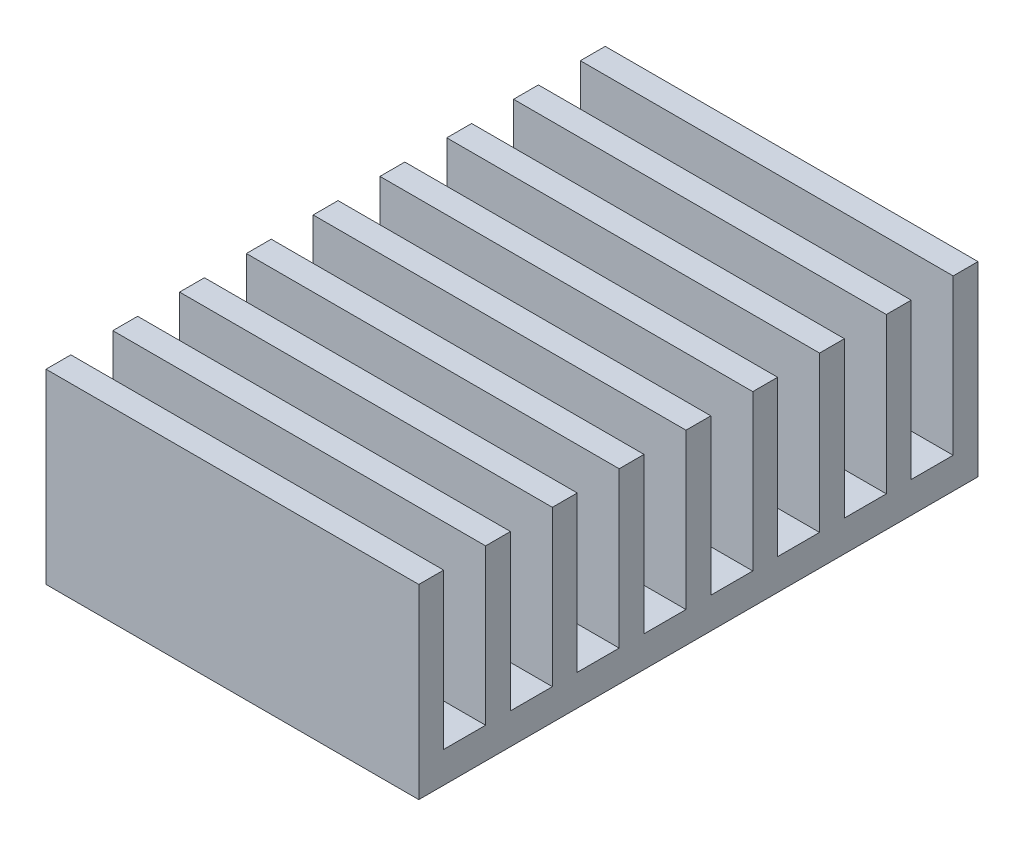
ISO-10303-21;
HEADER;
FILE_DESCRIPTION(('STEP AP214'),'2;1');
FILE_NAME('part.step','',(''),(''),'','','');
FILE_SCHEMA(('AUTOMOTIVE_DESIGN { 1 0 10303 214 1 1 1 1 }'));
ENDSEC;
DATA;
#1=APPLICATION_CONTEXT('core data for automotive mechanical design processes');
#2=APPLICATION_PROTOCOL_DEFINITION('international standard','automotive_design',2000,#1);
#3=PRODUCT_CONTEXT('',#1,'mechanical');
#4=PRODUCT('Part','Part','',(#3));
#5=PRODUCT_RELATED_PRODUCT_CATEGORY('part','',(#4));
#6=PRODUCT_DEFINITION_FORMATION('','',#4);
#7=PRODUCT_DEFINITION_CONTEXT('part definition',#1,'design');
#8=PRODUCT_DEFINITION('design','',#6,#7);
#9=PRODUCT_DEFINITION_SHAPE('','',#8);
#10=(LENGTH_UNIT() NAMED_UNIT(*) SI_UNIT(.MILLI.,.METRE.));
#11=(NAMED_UNIT(*) PLANE_ANGLE_UNIT() SI_UNIT($,.RADIAN.));
#12=(NAMED_UNIT(*) SI_UNIT($,.STERADIAN.) SOLID_ANGLE_UNIT());
#13=UNCERTAINTY_MEASURE_WITH_UNIT(LENGTH_MEASURE(1.E-05),#10,'distance_accuracy_value','');
#14=(GEOMETRIC_REPRESENTATION_CONTEXT(3) GLOBAL_UNCERTAINTY_ASSIGNED_CONTEXT((#13)) GLOBAL_UNIT_ASSIGNED_CONTEXT((#10,
#11,#12)) REPRESENTATION_CONTEXT('',''));
#15=CARTESIAN_POINT('',(0.,0.,0.));
#16=DIRECTION('',(0.,0.,1.));
#17=DIRECTION('',(1.,0.,0.));
#18=AXIS2_PLACEMENT_3D('',#15,#16,#17);
#19=CARTESIAN_POINT('',(15.,15.,-22.5));
#20=DIRECTION('',(0.,-1.,0.));
#21=DIRECTION('',(0.,0.,-1.));
#22=AXIS2_PLACEMENT_3D('',#19,#20,#21);
#23=PLANE('',#22);
#24=DIRECTION('',(0.,0.,1.));
#25=VECTOR('',#24,1.);
#26=CARTESIAN_POINT('',(15.,15.,-22.5));
#27=LINE('',#26,#25);
#28=CARTESIAN_POINT('',(15.,15.,20.5));
#29=VERTEX_POINT('',#28);
#30=CARTESIAN_POINT('',(15.,15.,22.5));
#31=VERTEX_POINT('',#30);
#32=EDGE_CURVE('E548',#29,#31,#27,.T.);
#33=ORIENTED_EDGE('',*,*,#32,.F.);
#34=DIRECTION('',(1.,0.,0.));
#35=VECTOR('',#34,1.);
#36=CARTESIAN_POINT('',(-15.,15.,20.5));
#37=LINE('',#36,#35);
#38=CARTESIAN_POINT('',(-15.,15.,20.5));
#39=VERTEX_POINT('',#38);
#40=EDGE_CURVE('E328',#39,#29,#37,.T.);
#41=ORIENTED_EDGE('',*,*,#40,.F.);
#42=DIRECTION('',(0.,0.,1.));
#43=VECTOR('',#42,1.);
#44=CARTESIAN_POINT('',(-15.,15.,-22.5));
#45=LINE('',#44,#43);
#46=CARTESIAN_POINT('',(-15.,15.,22.5));
#47=VERTEX_POINT('',#46);
#48=EDGE_CURVE('E311',#39,#47,#45,.T.);
#49=ORIENTED_EDGE('',*,*,#48,.T.);
#50=DIRECTION('',(-1.,0.,0.));
#51=VECTOR('',#50,1.);
#52=CARTESIAN_POINT('',(15.,15.,22.5));
#53=LINE('',#52,#51);
#54=EDGE_CURVE('E552',#31,#47,#53,.T.);
#55=ORIENTED_EDGE('',*,*,#54,.F.);
#56=EDGE_LOOP('',(#33,#41,#49,#55));
#57=FACE_BOUND('',#56,.T.);
#58=ADVANCED_FACE('F45',(#57),#23,.F.);
#59=CARTESIAN_POINT('',(-15.,15.,15.125));
#60=VERTEX_POINT('',#59);
#61=CARTESIAN_POINT('',(-15.,15.,17.125));
#62=VERTEX_POINT('',#61);
#63=EDGE_CURVE('E590',#60,#62,#45,.T.);
#64=ORIENTED_EDGE('',*,*,#63,.T.);
#65=DIRECTION('',(1.,0.,0.));
#66=VECTOR('',#65,1.);
#67=CARTESIAN_POINT('',(-15.,15.,17.125));
#68=LINE('',#67,#66);
#69=CARTESIAN_POINT('',(15.,15.,17.125));
#70=VERTEX_POINT('',#69);
#71=EDGE_CURVE('E331',#62,#70,#68,.T.);
#72=ORIENTED_EDGE('',*,*,#71,.T.);
#73=CARTESIAN_POINT('',(15.,15.,15.125));
#74=VERTEX_POINT('',#73);
#75=EDGE_CURVE('E658',#74,#70,#27,.T.);
#76=ORIENTED_EDGE('',*,*,#75,.F.);
#77=DIRECTION('',(1.,0.,0.));
#78=VECTOR('',#77,1.);
#79=CARTESIAN_POINT('',(-15.,15.,15.125));
#80=LINE('',#79,#78);
#81=EDGE_CURVE('E345',#60,#74,#80,.T.);
#82=ORIENTED_EDGE('',*,*,#81,.F.);
#83=EDGE_LOOP('',(#64,#72,#76,#82));
#84=FACE_BOUND('',#83,.T.);
#85=ADVANCED_FACE('F667',(#84),#23,.F.);
#86=CARTESIAN_POINT('',(-15.,15.,9.75000000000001));
#87=VERTEX_POINT('',#86);
#88=CARTESIAN_POINT('',(-15.,15.,11.75));
#89=VERTEX_POINT('',#88);
#90=EDGE_CURVE('E592',#87,#89,#45,.T.);
#91=ORIENTED_EDGE('',*,*,#90,.T.);
#92=DIRECTION('',(1.,0.,0.));
#93=VECTOR('',#92,1.);
#94=CARTESIAN_POINT('',(-15.,15.,11.75));
#95=LINE('',#94,#93);
#96=CARTESIAN_POINT('',(15.,15.,11.75));
#97=VERTEX_POINT('',#96);
#98=EDGE_CURVE('E342',#89,#97,#95,.T.);
#99=ORIENTED_EDGE('',*,*,#98,.T.);
#100=CARTESIAN_POINT('',(15.,15.,9.75000000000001));
#101=VERTEX_POINT('',#100);
#102=EDGE_CURVE('E653',#101,#97,#27,.T.);
#103=ORIENTED_EDGE('',*,*,#102,.F.);
#104=DIRECTION('',(1.,0.,0.));
#105=VECTOR('',#104,1.);
#106=CARTESIAN_POINT('',(-15.,15.,9.75000000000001));
#107=LINE('',#106,#105);
#108=EDGE_CURVE('E378',#87,#101,#107,.T.);
#109=ORIENTED_EDGE('',*,*,#108,.F.);
#110=EDGE_LOOP('',(#91,#99,#103,#109));
#111=FACE_BOUND('',#110,.T.);
#112=ADVANCED_FACE('F675',(#111),#23,.F.);
#113=CARTESIAN_POINT('',(-15.,15.,4.37500000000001));
#114=VERTEX_POINT('',#113);
#115=CARTESIAN_POINT('',(-15.,15.,6.375));
#116=VERTEX_POINT('',#115);
#117=EDGE_CURVE('E597',#114,#116,#45,.T.);
#118=ORIENTED_EDGE('',*,*,#117,.T.);
#119=DIRECTION('',(1.,0.,0.));
#120=VECTOR('',#119,1.);
#121=CARTESIAN_POINT('',(-15.,15.,6.375));
#122=LINE('',#121,#120);
#123=CARTESIAN_POINT('',(15.,15.,6.375));
#124=VERTEX_POINT('',#123);
#125=EDGE_CURVE('E375',#116,#124,#122,.T.);
#126=ORIENTED_EDGE('',*,*,#125,.T.);
#127=CARTESIAN_POINT('',(15.,15.,4.37500000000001));
#128=VERTEX_POINT('',#127);
#129=EDGE_CURVE('E648',#128,#124,#27,.T.);
#130=ORIENTED_EDGE('',*,*,#129,.F.);
#131=DIRECTION('',(1.,0.,0.));
#132=VECTOR('',#131,1.);
#133=CARTESIAN_POINT('',(-15.,15.,4.37500000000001));
#134=LINE('',#133,#132);
#135=EDGE_CURVE('E410',#114,#128,#134,.T.);
#136=ORIENTED_EDGE('',*,*,#135,.F.);
#137=EDGE_LOOP('',(#118,#126,#130,#136));
#138=FACE_BOUND('',#137,.T.);
#139=ADVANCED_FACE('F688',(#138),#23,.F.);
#140=CARTESIAN_POINT('',(-15.,15.,-0.999999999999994));
#141=VERTEX_POINT('',#140);
#142=CARTESIAN_POINT('',(-15.,15.,1.));
#143=VERTEX_POINT('',#142);
#144=EDGE_CURVE('E602',#141,#143,#45,.T.);
#145=ORIENTED_EDGE('',*,*,#144,.T.);
#146=DIRECTION('',(1.,0.,0.));
#147=VECTOR('',#146,1.);
#148=CARTESIAN_POINT('',(-15.,15.,1.));
#149=LINE('',#148,#147);
#150=CARTESIAN_POINT('',(15.,15.,1.));
#151=VERTEX_POINT('',#150);
#152=EDGE_CURVE('E406',#143,#151,#149,.T.);
#153=ORIENTED_EDGE('',*,*,#152,.T.);
#154=CARTESIAN_POINT('',(15.,15.,-0.999999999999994));
#155=VERTEX_POINT('',#154);
#156=EDGE_CURVE('E643',#155,#151,#27,.T.);
#157=ORIENTED_EDGE('',*,*,#156,.F.);
#158=DIRECTION('',(1.,0.,0.));
#159=VECTOR('',#158,1.);
#160=CARTESIAN_POINT('',(-15.,15.,-0.999999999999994));
#161=LINE('',#160,#159);
#162=EDGE_CURVE('E440',#141,#155,#161,.T.);
#163=ORIENTED_EDGE('',*,*,#162,.F.);
#164=EDGE_LOOP('',(#145,#153,#157,#163));
#165=FACE_BOUND('',#164,.T.);
#166=ADVANCED_FACE('F690',(#165),#23,.F.);
#167=CARTESIAN_POINT('',(-15.,15.,-6.375));
#168=VERTEX_POINT('',#167);
#169=CARTESIAN_POINT('',(-15.,15.,-4.375));
#170=VERTEX_POINT('',#169);
#171=EDGE_CURVE('E607',#168,#170,#45,.T.);
#172=ORIENTED_EDGE('',*,*,#171,.T.);
#173=DIRECTION('',(1.,0.,0.));
#174=VECTOR('',#173,1.);
#175=CARTESIAN_POINT('',(-15.,15.,-4.375));
#176=LINE('',#175,#174);
#177=CARTESIAN_POINT('',(15.,15.,-4.375));
#178=VERTEX_POINT('',#177);
#179=EDGE_CURVE('E436',#170,#178,#176,.T.);
#180=ORIENTED_EDGE('',*,*,#179,.T.);
#181=CARTESIAN_POINT('',(15.,15.,-6.375));
#182=VERTEX_POINT('',#181);
#183=EDGE_CURVE('E639',#182,#178,#27,.T.);
#184=ORIENTED_EDGE('',*,*,#183,.F.);
#185=DIRECTION('',(1.,0.,0.));
#186=VECTOR('',#185,1.);
#187=CARTESIAN_POINT('',(-15.,15.,-6.375));
#188=LINE('',#187,#186);
#189=EDGE_CURVE('E468',#168,#182,#188,.T.);
#190=ORIENTED_EDGE('',*,*,#189,.F.);
#191=EDGE_LOOP('',(#172,#180,#184,#190));
#192=FACE_BOUND('',#191,.T.);
#193=ADVANCED_FACE('F696',(#192),#23,.F.);
#194=CARTESIAN_POINT('',(-15.,15.,-11.75));
#195=VERTEX_POINT('',#194);
#196=CARTESIAN_POINT('',(-15.,15.,-9.75));
#197=VERTEX_POINT('',#196);
#198=EDGE_CURVE('E612',#195,#197,#45,.T.);
#199=ORIENTED_EDGE('',*,*,#198,.T.);
#200=DIRECTION('',(1.,0.,0.));
#201=VECTOR('',#200,1.);
#202=CARTESIAN_POINT('',(-15.,15.,-9.75));
#203=LINE('',#202,#201);
#204=CARTESIAN_POINT('',(15.,15.,-9.75));
#205=VERTEX_POINT('',#204);
#206=EDGE_CURVE('E465',#197,#205,#203,.T.);
#207=ORIENTED_EDGE('',*,*,#206,.T.);
#208=CARTESIAN_POINT('',(15.,15.,-11.75));
#209=VERTEX_POINT('',#208);
#210=EDGE_CURVE('E637',#209,#205,#27,.T.);
#211=ORIENTED_EDGE('',*,*,#210,.F.);
#212=DIRECTION('',(1.,0.,0.));
#213=VECTOR('',#212,1.);
#214=CARTESIAN_POINT('',(-15.,15.,-11.75));
#215=LINE('',#214,#213);
#216=EDGE_CURVE('E495',#195,#209,#215,.T.);
#217=ORIENTED_EDGE('',*,*,#216,.F.);
#218=EDGE_LOOP('',(#199,#207,#211,#217));
#219=FACE_BOUND('',#218,.T.);
#220=ADVANCED_FACE('F710',(#219),#23,.F.);
#221=CARTESIAN_POINT('',(-15.,15.,-17.125));
#222=VERTEX_POINT('',#221);
#223=CARTESIAN_POINT('',(-15.,15.,-15.125));
#224=VERTEX_POINT('',#223);
#225=EDGE_CURVE('E562',#222,#224,#45,.T.);
#226=ORIENTED_EDGE('',*,*,#225,.T.);
#227=DIRECTION('',(1.,0.,0.));
#228=VECTOR('',#227,1.);
#229=CARTESIAN_POINT('',(-15.,15.,-15.125));
#230=LINE('',#229,#228);
#231=CARTESIAN_POINT('',(15.,15.,-15.125));
#232=VERTEX_POINT('',#231);
#233=EDGE_CURVE('E492',#224,#232,#230,.T.);
#234=ORIENTED_EDGE('',*,*,#233,.T.);
#235=CARTESIAN_POINT('',(15.,15.,-17.125));
#236=VERTEX_POINT('',#235);
#237=EDGE_CURVE('E553',#236,#232,#27,.T.);
#238=ORIENTED_EDGE('',*,*,#237,.F.);
#239=DIRECTION('',(1.,0.,0.));
#240=VECTOR('',#239,1.);
#241=CARTESIAN_POINT('',(-15.,15.,-17.125));
#242=LINE('',#241,#240);
#243=EDGE_CURVE('E521',#222,#236,#242,.T.);
#244=ORIENTED_EDGE('',*,*,#243,.F.);
#245=EDGE_LOOP('',(#226,#234,#238,#244));
#246=FACE_BOUND('',#245,.T.);
#247=ADVANCED_FACE('F624',(#246),#23,.F.);
#248=CARTESIAN_POINT('',(15.,0.,22.5));
#249=DIRECTION('',(0.,0.,-1.));
#250=DIRECTION('',(-1.,0.,0.));
#251=AXIS2_PLACEMENT_3D('',#248,#249,#250);
#252=PLANE('',#251);
#253=DIRECTION('',(0.,-1.,0.));
#254=VECTOR('',#253,1.);
#255=CARTESIAN_POINT('',(-15.,0.,22.5));
#256=LINE('',#255,#254);
#257=CARTESIAN_POINT('',(-15.,0.,22.5));
#258=VERTEX_POINT('',#257);
#259=EDGE_CURVE('E330',#47,#258,#256,.T.);
#260=ORIENTED_EDGE('',*,*,#259,.T.);
#261=DIRECTION('',(-1.,0.,0.));
#262=VECTOR('',#261,1.);
#263=CARTESIAN_POINT('',(15.,0.,22.5));
#264=LINE('',#263,#262);
#265=CARTESIAN_POINT('',(15.,0.,22.5));
#266=VERTEX_POINT('',#265);
#267=EDGE_CURVE('E11',#266,#258,#264,.T.);
#268=ORIENTED_EDGE('',*,*,#267,.F.);
#269=DIRECTION('',(0.,-1.,0.));
#270=VECTOR('',#269,1.);
#271=CARTESIAN_POINT('',(15.,0.,22.5));
#272=LINE('',#271,#270);
#273=EDGE_CURVE('E538',#31,#266,#272,.T.);
#274=ORIENTED_EDGE('',*,*,#273,.F.);
#275=ORIENTED_EDGE('',*,*,#54,.T.);
#276=EDGE_LOOP('',(#260,#268,#274,#275));
#277=FACE_BOUND('',#276,.T.);
#278=ADVANCED_FACE('F47',(#277),#252,.F.);
#279=CARTESIAN_POINT('',(15.,0.,22.5));
#280=DIRECTION('',(0.,1.,0.));
#281=DIRECTION('',(0.,0.,1.));
#282=AXIS2_PLACEMENT_3D('',#279,#280,#281);
#283=PLANE('',#282);
#284=DIRECTION('',(0.,0.,-1.));
#285=VECTOR('',#284,1.);
#286=CARTESIAN_POINT('',(-15.,0.,22.5));
#287=LINE('',#286,#285);
#288=CARTESIAN_POINT('',(-15.,0.,-22.5));
#289=VERTEX_POINT('',#288);
#290=EDGE_CURVE('E556',#258,#289,#287,.T.);
#291=ORIENTED_EDGE('',*,*,#290,.T.);
#292=DIRECTION('',(-1.,0.,0.));
#293=VECTOR('',#292,1.);
#294=CARTESIAN_POINT('',(15.,0.,-22.5));
#295=LINE('',#294,#293);
#296=CARTESIAN_POINT('',(15.,0.,-22.5));
#297=VERTEX_POINT('',#296);
#298=EDGE_CURVE('E54',#297,#289,#295,.T.);
#299=ORIENTED_EDGE('',*,*,#298,.F.);
#300=DIRECTION('',(0.,0.,-1.));
#301=VECTOR('',#300,1.);
#302=CARTESIAN_POINT('',(15.,0.,22.5));
#303=LINE('',#302,#301);
#304=EDGE_CURVE('E542',#266,#297,#303,.T.);
#305=ORIENTED_EDGE('',*,*,#304,.F.);
#306=ORIENTED_EDGE('',*,*,#267,.T.);
#307=EDGE_LOOP('',(#291,#299,#305,#306));
#308=FACE_BOUND('',#307,.T.);
#309=ADVANCED_FACE('F585',(#308),#283,.F.);
#310=CARTESIAN_POINT('',(15.,0.,-22.5));
#311=DIRECTION('',(0.,0.,1.));
#312=DIRECTION('',(1.,0.,0.));
#313=AXIS2_PLACEMENT_3D('',#310,#311,#312);
#314=PLANE('',#313);
#315=DIRECTION('',(0.,1.,0.));
#316=VECTOR('',#315,1.);
#317=CARTESIAN_POINT('',(-15.,0.,-22.5));
#318=LINE('',#317,#316);
#319=CARTESIAN_POINT('',(-15.,15.,-22.5));
#320=VERTEX_POINT('',#319);
#321=EDGE_CURVE('E558',#289,#320,#318,.T.);
#322=ORIENTED_EDGE('',*,*,#321,.T.);
#323=DIRECTION('',(-1.,0.,0.));
#324=VECTOR('',#323,1.);
#325=CARTESIAN_POINT('',(15.,15.,-22.5));
#326=LINE('',#325,#324);
#327=CARTESIAN_POINT('',(15.,15.,-22.5));
#328=VERTEX_POINT('',#327);
#329=EDGE_CURVE('E565',#328,#320,#326,.T.);
#330=ORIENTED_EDGE('',*,*,#329,.F.);
#331=DIRECTION('',(0.,1.,0.));
#332=VECTOR('',#331,1.);
#333=CARTESIAN_POINT('',(15.,0.,-22.5));
#334=LINE('',#333,#332);
#335=EDGE_CURVE('E546',#297,#328,#334,.T.);
#336=ORIENTED_EDGE('',*,*,#335,.F.);
#337=ORIENTED_EDGE('',*,*,#298,.T.);
#338=EDGE_LOOP('',(#322,#330,#336,#337));
#339=FACE_BOUND('',#338,.T.);
#340=ADVANCED_FACE('F572',(#339),#314,.F.);
#341=CARTESIAN_POINT('',(-15.,15.,-20.5));
#342=VERTEX_POINT('',#341);
#343=EDGE_CURVE('E543',#320,#342,#45,.T.);
#344=ORIENTED_EDGE('',*,*,#343,.T.);
#345=DIRECTION('',(1.,0.,0.));
#346=VECTOR('',#345,1.);
#347=CARTESIAN_POINT('',(-15.,15.,-20.5));
#348=LINE('',#347,#346);
#349=CARTESIAN_POINT('',(15.,15.,-20.5));
#350=VERTEX_POINT('',#349);
#351=EDGE_CURVE('E518',#342,#350,#348,.T.);
#352=ORIENTED_EDGE('',*,*,#351,.T.);
#353=EDGE_CURVE('E549',#328,#350,#27,.T.);
#354=ORIENTED_EDGE('',*,*,#353,.F.);
#355=ORIENTED_EDGE('',*,*,#329,.T.);
#356=EDGE_LOOP('',(#344,#352,#354,#355));
#357=FACE_BOUND('',#356,.T.);
#358=ADVANCED_FACE('F577',(#357),#23,.F.);
#359=CARTESIAN_POINT('',(15.,0.,0.));
#360=DIRECTION('',(1.,0.,0.));
#361=DIRECTION('',(0.,0.,-1.));
#362=AXIS2_PLACEMENT_3D('',#359,#360,#361);
#363=PLANE('',#362);
#364=DIRECTION('',(0.,-1.,0.));
#365=VECTOR('',#364,1.);
#366=CARTESIAN_POINT('',(15.,15.,20.5));
#367=LINE('',#366,#365);
#368=CARTESIAN_POINT('',(15.,2.5,20.5));
#369=VERTEX_POINT('',#368);
#370=EDGE_CURVE('E295',#29,#369,#367,.T.);
#371=ORIENTED_EDGE('',*,*,#370,.F.);
#372=ORIENTED_EDGE('',*,*,#32,.T.);
#373=ORIENTED_EDGE('',*,*,#273,.T.);
#374=ORIENTED_EDGE('',*,*,#304,.T.);
#375=ORIENTED_EDGE('',*,*,#335,.T.);
#376=ORIENTED_EDGE('',*,*,#353,.T.);
#377=DIRECTION('',(0.,1.,0.));
#378=VECTOR('',#377,1.);
#379=CARTESIAN_POINT('',(15.,15.,-20.5));
#380=LINE('',#379,#378);
#381=CARTESIAN_POINT('',(15.,2.5,-20.5));
#382=VERTEX_POINT('',#381);
#383=EDGE_CURVE('E523',#382,#350,#380,.T.);
#384=ORIENTED_EDGE('',*,*,#383,.F.);
#385=DIRECTION('',(0.,0.,-1.));
#386=VECTOR('',#385,1.);
#387=CARTESIAN_POINT('',(15.,2.5,-17.125));
#388=LINE('',#387,#386);
#389=CARTESIAN_POINT('',(15.,2.5,-17.125));
#390=VERTEX_POINT('',#389);
#391=EDGE_CURVE('E525',#390,#382,#388,.T.);
#392=ORIENTED_EDGE('',*,*,#391,.F.);
#393=DIRECTION('',(0.,-1.,0.));
#394=VECTOR('',#393,1.);
#395=CARTESIAN_POINT('',(15.,15.,-17.125));
#396=LINE('',#395,#394);
#397=EDGE_CURVE('E497',#236,#390,#396,.T.);
#398=ORIENTED_EDGE('',*,*,#397,.F.);
#399=ORIENTED_EDGE('',*,*,#237,.T.);
#400=DIRECTION('',(0.,1.,0.));
#401=VECTOR('',#400,1.);
#402=CARTESIAN_POINT('',(15.,15.,-15.125));
#403=LINE('',#402,#401);
#404=CARTESIAN_POINT('',(15.,2.5,-15.125));
#405=VERTEX_POINT('',#404);
#406=EDGE_CURVE('E498',#405,#232,#403,.T.);
#407=ORIENTED_EDGE('',*,*,#406,.F.);
#408=DIRECTION('',(0.,0.,-1.));
#409=VECTOR('',#408,1.);
#410=CARTESIAN_POINT('',(15.,2.5,-11.75));
#411=LINE('',#410,#409);
#412=CARTESIAN_POINT('',(15.,2.5,-11.75));
#413=VERTEX_POINT('',#412);
#414=EDGE_CURVE('E500',#413,#405,#411,.T.);
#415=ORIENTED_EDGE('',*,*,#414,.F.);
#416=DIRECTION('',(0.,-1.,0.));
#417=VECTOR('',#416,1.);
#418=CARTESIAN_POINT('',(15.,15.,-11.75));
#419=LINE('',#418,#417);
#420=EDGE_CURVE('E471',#209,#413,#419,.T.);
#421=ORIENTED_EDGE('',*,*,#420,.F.);
#422=ORIENTED_EDGE('',*,*,#210,.T.);
#423=DIRECTION('',(0.,1.,0.));
#424=VECTOR('',#423,1.);
#425=CARTESIAN_POINT('',(15.,15.,-9.75));
#426=LINE('',#425,#424);
#427=CARTESIAN_POINT('',(15.,2.5,-9.75));
#428=VERTEX_POINT('',#427);
#429=EDGE_CURVE('E472',#428,#205,#426,.T.);
#430=ORIENTED_EDGE('',*,*,#429,.F.);
#431=DIRECTION('',(0.,0.,-1.));
#432=VECTOR('',#431,1.);
#433=CARTESIAN_POINT('',(15.,2.5,-6.375));
#434=LINE('',#433,#432);
#435=CARTESIAN_POINT('',(15.,2.5,-6.375));
#436=VERTEX_POINT('',#435);
#437=EDGE_CURVE('E474',#436,#428,#434,.T.);
#438=ORIENTED_EDGE('',*,*,#437,.F.);
#439=DIRECTION('',(0.,-1.,0.));
#440=VECTOR('',#439,1.);
#441=CARTESIAN_POINT('',(15.,15.,-6.375));
#442=LINE('',#441,#440);
#443=EDGE_CURVE('E443',#182,#436,#442,.T.);
#444=ORIENTED_EDGE('',*,*,#443,.F.);
#445=ORIENTED_EDGE('',*,*,#183,.T.);
#446=DIRECTION('',(0.,1.,0.));
#447=VECTOR('',#446,1.);
#448=CARTESIAN_POINT('',(15.,15.,-4.375));
#449=LINE('',#448,#447);
#450=CARTESIAN_POINT('',(15.,2.5,-4.375));
#451=VERTEX_POINT('',#450);
#452=EDGE_CURVE('E444',#451,#178,#449,.T.);
#453=ORIENTED_EDGE('',*,*,#452,.F.);
#454=DIRECTION('',(0.,0.,-1.));
#455=VECTOR('',#454,1.);
#456=CARTESIAN_POINT('',(15.,2.5,-0.999999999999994));
#457=LINE('',#456,#455);
#458=CARTESIAN_POINT('',(15.,2.5,-0.999999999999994));
#459=VERTEX_POINT('',#458);
#460=EDGE_CURVE('E446',#459,#451,#457,.T.);
#461=ORIENTED_EDGE('',*,*,#460,.F.);
#462=DIRECTION('',(0.,-1.,0.));
#463=VECTOR('',#462,1.);
#464=CARTESIAN_POINT('',(15.,15.,-0.999999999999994));
#465=LINE('',#464,#463);
#466=EDGE_CURVE('E413',#155,#459,#465,.T.);
#467=ORIENTED_EDGE('',*,*,#466,.F.);
#468=ORIENTED_EDGE('',*,*,#156,.T.);
#469=DIRECTION('',(0.,1.,0.));
#470=VECTOR('',#469,1.);
#471=CARTESIAN_POINT('',(15.,15.,1.));
#472=LINE('',#471,#470);
#473=CARTESIAN_POINT('',(15.,2.5,1.));
#474=VERTEX_POINT('',#473);
#475=EDGE_CURVE('E414',#474,#151,#472,.T.);
#476=ORIENTED_EDGE('',*,*,#475,.F.);
#477=DIRECTION('',(0.,0.,-1.));
#478=VECTOR('',#477,1.);
#479=CARTESIAN_POINT('',(15.,2.5,4.37500000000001));
#480=LINE('',#479,#478);
#481=CARTESIAN_POINT('',(15.,2.5,4.37500000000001));
#482=VERTEX_POINT('',#481);
#483=EDGE_CURVE('E416',#482,#474,#480,.T.);
#484=ORIENTED_EDGE('',*,*,#483,.F.);
#485=DIRECTION('',(0.,-1.,0.));
#486=VECTOR('',#485,1.);
#487=CARTESIAN_POINT('',(15.,15.,4.37500000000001));
#488=LINE('',#487,#486);
#489=EDGE_CURVE('E380',#128,#482,#488,.T.);
#490=ORIENTED_EDGE('',*,*,#489,.F.);
#491=ORIENTED_EDGE('',*,*,#129,.T.);
#492=DIRECTION('',(0.,1.,0.));
#493=VECTOR('',#492,1.);
#494=CARTESIAN_POINT('',(15.,15.,6.375));
#495=LINE('',#494,#493);
#496=CARTESIAN_POINT('',(15.,2.5,6.375));
#497=VERTEX_POINT('',#496);
#498=EDGE_CURVE('E381',#497,#124,#495,.T.);
#499=ORIENTED_EDGE('',*,*,#498,.F.);
#500=DIRECTION('',(0.,0.,-1.));
#501=VECTOR('',#500,1.);
#502=CARTESIAN_POINT('',(15.,2.5,9.75000000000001));
#503=LINE('',#502,#501);
#504=CARTESIAN_POINT('',(15.,2.5,9.75000000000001));
#505=VERTEX_POINT('',#504);
#506=EDGE_CURVE('E383',#505,#497,#503,.T.);
#507=ORIENTED_EDGE('',*,*,#506,.F.);
#508=DIRECTION('',(0.,-1.,0.));
#509=VECTOR('',#508,1.);
#510=CARTESIAN_POINT('',(15.,15.,9.75000000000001));
#511=LINE('',#510,#509);
#512=EDGE_CURVE('E347',#101,#505,#511,.T.);
#513=ORIENTED_EDGE('',*,*,#512,.F.);
#514=ORIENTED_EDGE('',*,*,#102,.T.);
#515=DIRECTION('',(0.,1.,0.));
#516=VECTOR('',#515,1.);
#517=CARTESIAN_POINT('',(15.,15.,11.75));
#518=LINE('',#517,#516);
#519=CARTESIAN_POINT('',(15.,2.5,11.75));
#520=VERTEX_POINT('',#519);
#521=EDGE_CURVE('E348',#520,#97,#518,.T.);
#522=ORIENTED_EDGE('',*,*,#521,.F.);
#523=DIRECTION('',(0.,0.,-1.));
#524=VECTOR('',#523,1.);
#525=CARTESIAN_POINT('',(15.,2.5,15.125));
#526=LINE('',#525,#524);
#527=CARTESIAN_POINT('',(15.,2.5,15.125));
#528=VERTEX_POINT('',#527);
#529=EDGE_CURVE('E351',#528,#520,#526,.T.);
#530=ORIENTED_EDGE('',*,*,#529,.F.);
#531=DIRECTION('',(0.,-1.,0.));
#532=VECTOR('',#531,1.);
#533=CARTESIAN_POINT('',(15.,15.,15.125));
#534=LINE('',#533,#532);
#535=EDGE_CURVE('E325',#74,#528,#534,.T.);
#536=ORIENTED_EDGE('',*,*,#535,.F.);
#537=ORIENTED_EDGE('',*,*,#75,.T.);
#538=DIRECTION('',(0.,1.,0.));
#539=VECTOR('',#538,1.);
#540=CARTESIAN_POINT('',(15.,15.,17.125));
#541=LINE('',#540,#539);
#542=CARTESIAN_POINT('',(15.,2.5,17.125));
#543=VERTEX_POINT('',#542);
#544=EDGE_CURVE('E313',#543,#70,#541,.T.);
#545=ORIENTED_EDGE('',*,*,#544,.F.);
#546=DIRECTION('',(0.,0.,-1.));
#547=VECTOR('',#546,1.);
#548=CARTESIAN_POINT('',(15.,2.5,20.5));
#549=LINE('',#548,#547);
#550=EDGE_CURVE('E318',#369,#543,#549,.T.);
#551=ORIENTED_EDGE('',*,*,#550,.F.);
#552=EDGE_LOOP('',(#371,#372,#373,#374,#375,#376,#384,#392,#398,#399,#407,#415,#421,#422,#430,
#438,#444,#445,#453,#461,#467,#468,#476,#484,#490,#491,#499,#507,#513,#514,#522,#530,#536,#537,
#545,#551));
#553=FACE_BOUND('',#552,.T.);
#554=ADVANCED_FACE('F581',(#553),#363,.T.);
#555=CARTESIAN_POINT('',(-15.,0.,0.));
#556=DIRECTION('',(1.,0.,0.));
#557=DIRECTION('',(0.,0.,-1.));
#558=AXIS2_PLACEMENT_3D('',#555,#556,#557);
#559=PLANE('',#558);
#560=ORIENTED_EDGE('',*,*,#48,.F.);
#561=DIRECTION('',(0.,-1.,0.));
#562=VECTOR('',#561,1.);
#563=CARTESIAN_POINT('',(-15.,15.,20.5));
#564=LINE('',#563,#562);
#565=CARTESIAN_POINT('',(-15.,2.5,20.5));
#566=VERTEX_POINT('',#565);
#567=EDGE_CURVE('E292',#39,#566,#564,.T.);
#568=ORIENTED_EDGE('',*,*,#567,.T.);
#569=DIRECTION('',(0.,0.,-1.));
#570=VECTOR('',#569,1.);
#571=CARTESIAN_POINT('',(-15.,2.5,20.5));
#572=LINE('',#571,#570);
#573=CARTESIAN_POINT('',(-15.,2.5,17.125));
#574=VERTEX_POINT('',#573);
#575=EDGE_CURVE('E303',#566,#574,#572,.T.);
#576=ORIENTED_EDGE('',*,*,#575,.T.);
#577=DIRECTION('',(0.,1.,0.));
#578=VECTOR('',#577,1.);
#579=CARTESIAN_POINT('',(-15.,15.,17.125));
#580=LINE('',#579,#578);
#581=EDGE_CURVE('E64',#574,#62,#580,.T.);
#582=ORIENTED_EDGE('',*,*,#581,.T.);
#583=ORIENTED_EDGE('',*,*,#63,.F.);
#584=DIRECTION('',(0.,-1.,0.));
#585=VECTOR('',#584,1.);
#586=CARTESIAN_POINT('',(-15.,15.,15.125));
#587=LINE('',#586,#585);
#588=CARTESIAN_POINT('',(-15.,2.5,15.125));
#589=VERTEX_POINT('',#588);
#590=EDGE_CURVE('E352',#60,#589,#587,.T.);
#591=ORIENTED_EDGE('',*,*,#590,.T.);
#592=DIRECTION('',(0.,0.,-1.));
#593=VECTOR('',#592,1.);
#594=CARTESIAN_POINT('',(-15.,2.5,15.125));
#595=LINE('',#594,#593);
#596=CARTESIAN_POINT('',(-15.,2.5,11.75));
#597=VERTEX_POINT('',#596);
#598=EDGE_CURVE('E361',#589,#597,#595,.T.);
#599=ORIENTED_EDGE('',*,*,#598,.T.);
#600=DIRECTION('',(0.,1.,0.));
#601=VECTOR('',#600,1.);
#602=CARTESIAN_POINT('',(-15.,15.,11.75));
#603=LINE('',#602,#601);
#604=EDGE_CURVE('E74',#597,#89,#603,.T.);
#605=ORIENTED_EDGE('',*,*,#604,.T.);
#606=ORIENTED_EDGE('',*,*,#90,.F.);
#607=DIRECTION('',(0.,-1.,0.));
#608=VECTOR('',#607,1.);
#609=CARTESIAN_POINT('',(-15.,15.,9.75000000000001));
#610=LINE('',#609,#608);
#611=CARTESIAN_POINT('',(-15.,2.5,9.75000000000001));
#612=VERTEX_POINT('',#611);
#613=EDGE_CURVE('E384',#87,#612,#610,.T.);
#614=ORIENTED_EDGE('',*,*,#613,.T.);
#615=DIRECTION('',(0.,0.,-1.));
#616=VECTOR('',#615,1.);
#617=CARTESIAN_POINT('',(-15.,2.5,9.75000000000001));
#618=LINE('',#617,#616);
#619=CARTESIAN_POINT('',(-15.,2.5,6.375));
#620=VERTEX_POINT('',#619);
#621=EDGE_CURVE('E393',#612,#620,#618,.T.);
#622=ORIENTED_EDGE('',*,*,#621,.T.);
#623=DIRECTION('',(0.,1.,0.));
#624=VECTOR('',#623,1.);
#625=CARTESIAN_POINT('',(-15.,15.,6.375));
#626=LINE('',#625,#624);
#627=EDGE_CURVE('E371',#620,#116,#626,.T.);
#628=ORIENTED_EDGE('',*,*,#627,.T.);
#629=ORIENTED_EDGE('',*,*,#117,.F.);
#630=DIRECTION('',(0.,-1.,0.));
#631=VECTOR('',#630,1.);
#632=CARTESIAN_POINT('',(-15.,15.,4.37500000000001));
#633=LINE('',#632,#631);
#634=CARTESIAN_POINT('',(-15.,2.5,4.37500000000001));
#635=VERTEX_POINT('',#634);
#636=EDGE_CURVE('E417',#114,#635,#633,.T.);
#637=ORIENTED_EDGE('',*,*,#636,.T.);
#638=DIRECTION('',(0.,0.,-1.));
#639=VECTOR('',#638,1.);
#640=CARTESIAN_POINT('',(-15.,2.5,4.37500000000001));
#641=LINE('',#640,#639);
#642=CARTESIAN_POINT('',(-15.,2.5,1.));
#643=VERTEX_POINT('',#642);
#644=EDGE_CURVE('E424',#635,#643,#641,.T.);
#645=ORIENTED_EDGE('',*,*,#644,.T.);
#646=DIRECTION('',(0.,1.,0.));
#647=VECTOR('',#646,1.);
#648=CARTESIAN_POINT('',(-15.,15.,1.));
#649=LINE('',#648,#647);
#650=EDGE_CURVE('E402',#643,#143,#649,.T.);
#651=ORIENTED_EDGE('',*,*,#650,.T.);
#652=ORIENTED_EDGE('',*,*,#144,.F.);
#653=DIRECTION('',(0.,-1.,0.));
#654=VECTOR('',#653,1.);
#655=CARTESIAN_POINT('',(-15.,15.,-0.999999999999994));
#656=LINE('',#655,#654);
#657=CARTESIAN_POINT('',(-15.,2.5,-0.999999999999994));
#658=VERTEX_POINT('',#657);
#659=EDGE_CURVE('E447',#141,#658,#656,.T.);
#660=ORIENTED_EDGE('',*,*,#659,.T.);
#661=DIRECTION('',(0.,0.,-1.));
#662=VECTOR('',#661,1.);
#663=CARTESIAN_POINT('',(-15.,2.5,-0.999999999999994));
#664=LINE('',#663,#662);
#665=CARTESIAN_POINT('',(-15.,2.5,-4.375));
#666=VERTEX_POINT('',#665);
#667=EDGE_CURVE('E454',#658,#666,#664,.T.);
#668=ORIENTED_EDGE('',*,*,#667,.T.);
#669=DIRECTION('',(0.,1.,0.));
#670=VECTOR('',#669,1.);
#671=CARTESIAN_POINT('',(-15.,15.,-4.375));
#672=LINE('',#671,#670);
#673=EDGE_CURVE('E432',#666,#170,#672,.T.);
#674=ORIENTED_EDGE('',*,*,#673,.T.);
#675=ORIENTED_EDGE('',*,*,#171,.F.);
#676=DIRECTION('',(0.,-1.,0.));
#677=VECTOR('',#676,1.);
#678=CARTESIAN_POINT('',(-15.,15.,-6.375));
#679=LINE('',#678,#677);
#680=CARTESIAN_POINT('',(-15.,2.5,-6.375));
#681=VERTEX_POINT('',#680);
#682=EDGE_CURVE('E475',#168,#681,#679,.T.);
#683=ORIENTED_EDGE('',*,*,#682,.T.);
#684=DIRECTION('',(0.,0.,-1.));
#685=VECTOR('',#684,1.);
#686=CARTESIAN_POINT('',(-15.,2.5,-6.375));
#687=LINE('',#686,#685);
#688=CARTESIAN_POINT('',(-15.,2.5,-9.75));
#689=VERTEX_POINT('',#688);
#690=EDGE_CURVE('E482',#681,#689,#687,.T.);
#691=ORIENTED_EDGE('',*,*,#690,.T.);
#692=DIRECTION('',(0.,1.,0.));
#693=VECTOR('',#692,1.);
#694=CARTESIAN_POINT('',(-15.,15.,-9.75));
#695=LINE('',#694,#693);
#696=EDGE_CURVE('E462',#689,#197,#695,.T.);
#697=ORIENTED_EDGE('',*,*,#696,.T.);
#698=ORIENTED_EDGE('',*,*,#198,.F.);
#699=DIRECTION('',(0.,-1.,0.));
#700=VECTOR('',#699,1.);
#701=CARTESIAN_POINT('',(-15.,15.,-11.75));
#702=LINE('',#701,#700);
#703=CARTESIAN_POINT('',(-15.,2.5,-11.75));
#704=VERTEX_POINT('',#703);
#705=EDGE_CURVE('E501',#195,#704,#702,.T.);
#706=ORIENTED_EDGE('',*,*,#705,.T.);
#707=DIRECTION('',(0.,0.,-1.));
#708=VECTOR('',#707,1.);
#709=CARTESIAN_POINT('',(-15.,2.5,-11.75));
#710=LINE('',#709,#708);
#711=CARTESIAN_POINT('',(-15.,2.5,-15.125));
#712=VERTEX_POINT('',#711);
#713=EDGE_CURVE('E508',#704,#712,#710,.T.);
#714=ORIENTED_EDGE('',*,*,#713,.T.);
#715=DIRECTION('',(0.,1.,0.));
#716=VECTOR('',#715,1.);
#717=CARTESIAN_POINT('',(-15.,15.,-15.125));
#718=LINE('',#717,#716);
#719=EDGE_CURVE('E489',#712,#224,#718,.T.);
#720=ORIENTED_EDGE('',*,*,#719,.T.);
#721=ORIENTED_EDGE('',*,*,#225,.F.);
#722=DIRECTION('',(0.,-1.,0.));
#723=VECTOR('',#722,1.);
#724=CARTESIAN_POINT('',(-15.,15.,-17.125));
#725=LINE('',#724,#723);
#726=CARTESIAN_POINT('',(-15.,2.5,-17.125));
#727=VERTEX_POINT('',#726);
#728=EDGE_CURVE('E526',#222,#727,#725,.T.);
#729=ORIENTED_EDGE('',*,*,#728,.T.);
#730=DIRECTION('',(0.,0.,-1.));
#731=VECTOR('',#730,1.);
#732=CARTESIAN_POINT('',(-15.,2.5,-17.125));
#733=LINE('',#732,#731);
#734=CARTESIAN_POINT('',(-15.,2.5,-20.5));
#735=VERTEX_POINT('',#734);
#736=EDGE_CURVE('E533',#727,#735,#733,.T.);
#737=ORIENTED_EDGE('',*,*,#736,.T.);
#738=DIRECTION('',(0.,1.,0.));
#739=VECTOR('',#738,1.);
#740=CARTESIAN_POINT('',(-15.,15.,-20.5));
#741=LINE('',#740,#739);
#742=EDGE_CURVE('E515',#735,#342,#741,.T.);
#743=ORIENTED_EDGE('',*,*,#742,.T.);
#744=ORIENTED_EDGE('',*,*,#343,.F.);
#745=ORIENTED_EDGE('',*,*,#321,.F.);
#746=ORIENTED_EDGE('',*,*,#290,.F.);
#747=ORIENTED_EDGE('',*,*,#259,.F.);
#748=EDGE_LOOP('',(#560,#568,#576,#582,#583,#591,#599,#605,#606,#614,#622,#628,#629,#637,#645,
#651,#652,#660,#668,#674,#675,#683,#691,#697,#698,#706,#714,#720,#721,#729,#737,#743,#744,#745,
#746,#747));
#749=FACE_BOUND('',#748,.T.);
#750=ADVANCED_FACE('F309',(#749),#559,.F.);
#751=CARTESIAN_POINT('',(-15.,15.,-17.125));
#752=DIRECTION('',(0.,0.,1.));
#753=DIRECTION('',(1.,0.,0.));
#754=AXIS2_PLACEMENT_3D('',#751,#752,#753);
#755=PLANE('',#754);
#756=ORIENTED_EDGE('',*,*,#397,.T.);
#757=DIRECTION('',(1.,0.,0.));
#758=VECTOR('',#757,1.);
#759=CARTESIAN_POINT('',(-15.,2.5,-17.125));
#760=LINE('',#759,#758);
#761=EDGE_CURVE('E513',#727,#390,#760,.T.);
#762=ORIENTED_EDGE('',*,*,#761,.F.);
#763=ORIENTED_EDGE('',*,*,#728,.F.);
#764=ORIENTED_EDGE('',*,*,#243,.T.);
#765=EDGE_LOOP('',(#756,#762,#763,#764));
#766=FACE_BOUND('',#765,.T.);
#767=ADVANCED_FACE('F971',(#766),#755,.F.);
#768=CARTESIAN_POINT('',(-15.,15.,-20.5));
#769=DIRECTION('',(0.,0.,-1.));
#770=DIRECTION('',(-1.,0.,0.));
#771=AXIS2_PLACEMENT_3D('',#768,#769,#770);
#772=PLANE('',#771);
#773=ORIENTED_EDGE('',*,*,#383,.T.);
#774=ORIENTED_EDGE('',*,*,#351,.F.);
#775=ORIENTED_EDGE('',*,*,#742,.F.);
#776=DIRECTION('',(1.,0.,0.));
#777=VECTOR('',#776,1.);
#778=CARTESIAN_POINT('',(-15.,2.5,-20.5));
#779=LINE('',#778,#777);
#780=EDGE_CURVE('E516',#735,#382,#779,.T.);
#781=ORIENTED_EDGE('',*,*,#780,.T.);
#782=EDGE_LOOP('',(#773,#774,#775,#781));
#783=FACE_BOUND('',#782,.T.);
#784=ADVANCED_FACE('F960',(#783),#772,.F.);
#785=CARTESIAN_POINT('',(-15.,2.5,-17.125));
#786=DIRECTION('',(0.,-1.,0.));
#787=DIRECTION('',(0.,0.,-1.));
#788=AXIS2_PLACEMENT_3D('',#785,#786,#787);
#789=PLANE('',#788);
#790=ORIENTED_EDGE('',*,*,#391,.T.);
#791=ORIENTED_EDGE('',*,*,#780,.F.);
#792=ORIENTED_EDGE('',*,*,#736,.F.);
#793=ORIENTED_EDGE('',*,*,#761,.T.);
#794=EDGE_LOOP('',(#790,#791,#792,#793));
#795=FACE_BOUND('',#794,.T.);
#796=ADVANCED_FACE('F949',(#795),#789,.F.);
#797=CARTESIAN_POINT('',(-15.,15.,-11.75));
#798=DIRECTION('',(0.,0.,1.));
#799=DIRECTION('',(1.,0.,0.));
#800=AXIS2_PLACEMENT_3D('',#797,#798,#799);
#801=PLANE('',#800);
#802=ORIENTED_EDGE('',*,*,#420,.T.);
#803=DIRECTION('',(1.,0.,0.));
#804=VECTOR('',#803,1.);
#805=CARTESIAN_POINT('',(-15.,2.5,-11.75));
#806=LINE('',#805,#804);
#807=EDGE_CURVE('E487',#704,#413,#806,.T.);
#808=ORIENTED_EDGE('',*,*,#807,.F.);
#809=ORIENTED_EDGE('',*,*,#705,.F.);
#810=ORIENTED_EDGE('',*,*,#216,.T.);
#811=EDGE_LOOP('',(#802,#808,#809,#810));
#812=FACE_BOUND('',#811,.T.);
#813=ADVANCED_FACE('F939',(#812),#801,.F.);
#814=CARTESIAN_POINT('',(-15.,15.,-15.125));
#815=DIRECTION('',(0.,0.,-1.));
#816=DIRECTION('',(-1.,0.,0.));
#817=AXIS2_PLACEMENT_3D('',#814,#815,#816);
#818=PLANE('',#817);
#819=ORIENTED_EDGE('',*,*,#406,.T.);
#820=ORIENTED_EDGE('',*,*,#233,.F.);
#821=ORIENTED_EDGE('',*,*,#719,.F.);
#822=DIRECTION('',(1.,0.,0.));
#823=VECTOR('',#822,1.);
#824=CARTESIAN_POINT('',(-15.,2.5,-15.125));
#825=LINE('',#824,#823);
#826=EDGE_CURVE('E490',#712,#405,#825,.T.);
#827=ORIENTED_EDGE('',*,*,#826,.T.);
#828=EDGE_LOOP('',(#819,#820,#821,#827));
#829=FACE_BOUND('',#828,.T.);
#830=ADVANCED_FACE('F630',(#829),#818,.F.);
#831=CARTESIAN_POINT('',(-15.,2.5,-11.75));
#832=DIRECTION('',(0.,-1.,0.));
#833=DIRECTION('',(0.,0.,-1.));
#834=AXIS2_PLACEMENT_3D('',#831,#832,#833);
#835=PLANE('',#834);
#836=ORIENTED_EDGE('',*,*,#414,.T.);
#837=ORIENTED_EDGE('',*,*,#826,.F.);
#838=ORIENTED_EDGE('',*,*,#713,.F.);
#839=ORIENTED_EDGE('',*,*,#807,.T.);
#840=EDGE_LOOP('',(#836,#837,#838,#839));
#841=FACE_BOUND('',#840,.T.);
#842=ADVANCED_FACE('F632',(#841),#835,.F.);
#843=CARTESIAN_POINT('',(-15.,15.,-6.375));
#844=DIRECTION('',(0.,0.,1.));
#845=DIRECTION('',(1.,0.,0.));
#846=AXIS2_PLACEMENT_3D('',#843,#844,#845);
#847=PLANE('',#846);
#848=ORIENTED_EDGE('',*,*,#443,.T.);
#849=DIRECTION('',(1.,0.,0.));
#850=VECTOR('',#849,1.);
#851=CARTESIAN_POINT('',(-15.,2.5,-6.375));
#852=LINE('',#851,#850);
#853=EDGE_CURVE('E459',#681,#436,#852,.T.);
#854=ORIENTED_EDGE('',*,*,#853,.F.);
#855=ORIENTED_EDGE('',*,*,#682,.F.);
#856=ORIENTED_EDGE('',*,*,#189,.T.);
#857=EDGE_LOOP('',(#848,#854,#855,#856));
#858=FACE_BOUND('',#857,.T.);
#859=ADVANCED_FACE('F909',(#858),#847,.F.);
#860=CARTESIAN_POINT('',(-15.,15.,-9.75));
#861=DIRECTION('',(0.,0.,-1.));
#862=DIRECTION('',(-1.,0.,0.));
#863=AXIS2_PLACEMENT_3D('',#860,#861,#862);
#864=PLANE('',#863);
#865=ORIENTED_EDGE('',*,*,#429,.T.);
#866=ORIENTED_EDGE('',*,*,#206,.F.);
#867=ORIENTED_EDGE('',*,*,#696,.F.);
#868=DIRECTION('',(1.,0.,0.));
#869=VECTOR('',#868,1.);
#870=CARTESIAN_POINT('',(-15.,2.5,-9.75));
#871=LINE('',#870,#869);
#872=EDGE_CURVE('E463',#689,#428,#871,.T.);
#873=ORIENTED_EDGE('',*,*,#872,.T.);
#874=EDGE_LOOP('',(#865,#866,#867,#873));
#875=FACE_BOUND('',#874,.T.);
#876=ADVANCED_FACE('F898',(#875),#864,.F.);
#877=CARTESIAN_POINT('',(-15.,2.5,-6.375));
#878=DIRECTION('',(0.,-1.,0.));
#879=DIRECTION('',(0.,0.,-1.));
#880=AXIS2_PLACEMENT_3D('',#877,#878,#879);
#881=PLANE('',#880);
#882=ORIENTED_EDGE('',*,*,#437,.T.);
#883=ORIENTED_EDGE('',*,*,#872,.F.);
#884=ORIENTED_EDGE('',*,*,#690,.F.);
#885=ORIENTED_EDGE('',*,*,#853,.T.);
#886=EDGE_LOOP('',(#882,#883,#884,#885));
#887=FACE_BOUND('',#886,.T.);
#888=ADVANCED_FACE('F887',(#887),#881,.F.);
#889=CARTESIAN_POINT('',(-15.,15.,-0.999999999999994));
#890=DIRECTION('',(0.,0.,1.));
#891=DIRECTION('',(1.,0.,0.));
#892=AXIS2_PLACEMENT_3D('',#889,#890,#891);
#893=PLANE('',#892);
#894=ORIENTED_EDGE('',*,*,#466,.T.);
#895=DIRECTION('',(1.,0.,0.));
#896=VECTOR('',#895,1.);
#897=CARTESIAN_POINT('',(-15.,2.5,-0.999999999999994));
#898=LINE('',#897,#896);
#899=EDGE_CURVE('E429',#658,#459,#898,.T.);
#900=ORIENTED_EDGE('',*,*,#899,.F.);
#901=ORIENTED_EDGE('',*,*,#659,.F.);
#902=ORIENTED_EDGE('',*,*,#162,.T.);
#903=EDGE_LOOP('',(#894,#900,#901,#902));
#904=FACE_BOUND('',#903,.T.);
#905=ADVANCED_FACE('F876',(#904),#893,.F.);
#906=CARTESIAN_POINT('',(-15.,15.,-4.375));
#907=DIRECTION('',(0.,0.,-1.));
#908=DIRECTION('',(-1.,0.,0.));
#909=AXIS2_PLACEMENT_3D('',#906,#907,#908);
#910=PLANE('',#909);
#911=ORIENTED_EDGE('',*,*,#452,.T.);
#912=ORIENTED_EDGE('',*,*,#179,.F.);
#913=ORIENTED_EDGE('',*,*,#673,.F.);
#914=DIRECTION('',(1.,0.,0.));
#915=VECTOR('',#914,1.);
#916=CARTESIAN_POINT('',(-15.,2.5,-4.375));
#917=LINE('',#916,#915);
#918=EDGE_CURVE('E433',#666,#451,#917,.T.);
#919=ORIENTED_EDGE('',*,*,#918,.T.);
#920=EDGE_LOOP('',(#911,#912,#913,#919));
#921=FACE_BOUND('',#920,.T.);
#922=ADVANCED_FACE('F865',(#921),#910,.F.);
#923=CARTESIAN_POINT('',(-15.,2.5,-0.999999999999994));
#924=DIRECTION('',(0.,-1.,0.));
#925=DIRECTION('',(0.,0.,-1.));
#926=AXIS2_PLACEMENT_3D('',#923,#924,#925);
#927=PLANE('',#926);
#928=ORIENTED_EDGE('',*,*,#460,.T.);
#929=ORIENTED_EDGE('',*,*,#918,.F.);
#930=ORIENTED_EDGE('',*,*,#667,.F.);
#931=ORIENTED_EDGE('',*,*,#899,.T.);
#932=EDGE_LOOP('',(#928,#929,#930,#931));
#933=FACE_BOUND('',#932,.T.);
#934=ADVANCED_FACE('F855',(#933),#927,.F.);
#935=CARTESIAN_POINT('',(-15.,15.,4.37500000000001));
#936=DIRECTION('',(0.,0.,1.));
#937=DIRECTION('',(1.,0.,0.));
#938=AXIS2_PLACEMENT_3D('',#935,#936,#937);
#939=PLANE('',#938);
#940=ORIENTED_EDGE('',*,*,#489,.T.);
#941=DIRECTION('',(1.,0.,0.));
#942=VECTOR('',#941,1.);
#943=CARTESIAN_POINT('',(-15.,2.5,4.37500000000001));
#944=LINE('',#943,#942);
#945=EDGE_CURVE('E399',#635,#482,#944,.T.);
#946=ORIENTED_EDGE('',*,*,#945,.F.);
#947=ORIENTED_EDGE('',*,*,#636,.F.);
#948=ORIENTED_EDGE('',*,*,#135,.T.);
#949=EDGE_LOOP('',(#940,#946,#947,#948));
#950=FACE_BOUND('',#949,.T.);
#951=ADVANCED_FACE('F687',(#950),#939,.F.);
#952=CARTESIAN_POINT('',(-15.,15.,1.));
#953=DIRECTION('',(0.,0.,-1.));
#954=DIRECTION('',(-1.,0.,0.));
#955=AXIS2_PLACEMENT_3D('',#952,#953,#954);
#956=PLANE('',#955);
#957=ORIENTED_EDGE('',*,*,#475,.T.);
#958=ORIENTED_EDGE('',*,*,#152,.F.);
#959=ORIENTED_EDGE('',*,*,#650,.F.);
#960=DIRECTION('',(1.,0.,0.));
#961=VECTOR('',#960,1.);
#962=CARTESIAN_POINT('',(-15.,2.5,1.));
#963=LINE('',#962,#961);
#964=EDGE_CURVE('E403',#643,#474,#963,.T.);
#965=ORIENTED_EDGE('',*,*,#964,.T.);
#966=EDGE_LOOP('',(#957,#958,#959,#965));
#967=FACE_BOUND('',#966,.T.);
#968=ADVANCED_FACE('F834',(#967),#956,.F.);
#969=CARTESIAN_POINT('',(-15.,2.5,4.37500000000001));
#970=DIRECTION('',(0.,-1.,0.));
#971=DIRECTION('',(0.,0.,-1.));
#972=AXIS2_PLACEMENT_3D('',#969,#970,#971);
#973=PLANE('',#972);
#974=ORIENTED_EDGE('',*,*,#483,.T.);
#975=ORIENTED_EDGE('',*,*,#964,.F.);
#976=ORIENTED_EDGE('',*,*,#644,.F.);
#977=ORIENTED_EDGE('',*,*,#945,.T.);
#978=EDGE_LOOP('',(#974,#975,#976,#977));
#979=FACE_BOUND('',#978,.T.);
#980=ADVANCED_FACE('F824',(#979),#973,.F.);
#981=CARTESIAN_POINT('',(-15.,15.,9.75000000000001));
#982=DIRECTION('',(0.,0.,1.));
#983=DIRECTION('',(1.,0.,0.));
#984=AXIS2_PLACEMENT_3D('',#981,#982,#983);
#985=PLANE('',#984);
#986=ORIENTED_EDGE('',*,*,#512,.T.);
#987=DIRECTION('',(1.,0.,0.));
#988=VECTOR('',#987,1.);
#989=CARTESIAN_POINT('',(-15.,2.5,9.75000000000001));
#990=LINE('',#989,#988);
#991=EDGE_CURVE('E368',#612,#505,#990,.T.);
#992=ORIENTED_EDGE('',*,*,#991,.F.);
#993=ORIENTED_EDGE('',*,*,#613,.F.);
#994=ORIENTED_EDGE('',*,*,#108,.T.);
#995=EDGE_LOOP('',(#986,#992,#993,#994));
#996=FACE_BOUND('',#995,.T.);
#997=ADVANCED_FACE('F678',(#996),#985,.F.);
#998=CARTESIAN_POINT('',(-15.,15.,6.375));
#999=DIRECTION('',(0.,0.,-1.));
#1000=DIRECTION('',(-1.,0.,0.));
#1001=AXIS2_PLACEMENT_3D('',#998,#999,#1000);
#1002=PLANE('',#1001);
#1003=ORIENTED_EDGE('',*,*,#498,.T.);
#1004=ORIENTED_EDGE('',*,*,#125,.F.);
#1005=ORIENTED_EDGE('',*,*,#627,.F.);
#1006=DIRECTION('',(1.,0.,0.));
#1007=VECTOR('',#1006,1.);
#1008=CARTESIAN_POINT('',(-15.,2.5,6.375));
#1009=LINE('',#1008,#1007);
#1010=EDGE_CURVE('E372',#620,#497,#1009,.T.);
#1011=ORIENTED_EDGE('',*,*,#1010,.T.);
#1012=EDGE_LOOP('',(#1003,#1004,#1005,#1011));
#1013=FACE_BOUND('',#1012,.T.);
#1014=ADVANCED_FACE('F684',(#1013),#1002,.F.);
#1015=CARTESIAN_POINT('',(-15.,2.5,9.75000000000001));
#1016=DIRECTION('',(0.,-1.,0.));
#1017=DIRECTION('',(0.,0.,-1.));
#1018=AXIS2_PLACEMENT_3D('',#1015,#1016,#1017);
#1019=PLANE('',#1018);
#1020=ORIENTED_EDGE('',*,*,#506,.T.);
#1021=ORIENTED_EDGE('',*,*,#1010,.F.);
#1022=ORIENTED_EDGE('',*,*,#621,.F.);
#1023=ORIENTED_EDGE('',*,*,#991,.T.);
#1024=EDGE_LOOP('',(#1020,#1021,#1022,#1023));
#1025=FACE_BOUND('',#1024,.T.);
#1026=ADVANCED_FACE('F682',(#1025),#1019,.F.);
#1027=CARTESIAN_POINT('',(-15.,15.,15.125));
#1028=DIRECTION('',(0.,0.,1.));
#1029=DIRECTION('',(1.,0.,0.));
#1030=AXIS2_PLACEMENT_3D('',#1027,#1028,#1029);
#1031=PLANE('',#1030);
#1032=ORIENTED_EDGE('',*,*,#535,.T.);
#1033=DIRECTION('',(1.,0.,0.));
#1034=VECTOR('',#1033,1.);
#1035=CARTESIAN_POINT('',(-15.,2.5,15.125));
#1036=LINE('',#1035,#1034);
#1037=EDGE_CURVE('E336',#589,#528,#1036,.T.);
#1038=ORIENTED_EDGE('',*,*,#1037,.F.);
#1039=ORIENTED_EDGE('',*,*,#590,.F.);
#1040=ORIENTED_EDGE('',*,*,#81,.T.);
#1041=EDGE_LOOP('',(#1032,#1038,#1039,#1040));
#1042=FACE_BOUND('',#1041,.T.);
#1043=ADVANCED_FACE('F670',(#1042),#1031,.F.);
#1044=CARTESIAN_POINT('',(-15.,15.,11.75));
#1045=DIRECTION('',(0.,0.,-1.));
#1046=DIRECTION('',(-1.,0.,0.));
#1047=AXIS2_PLACEMENT_3D('',#1044,#1045,#1046);
#1048=PLANE('',#1047);
#1049=ORIENTED_EDGE('',*,*,#521,.T.);
#1050=ORIENTED_EDGE('',*,*,#98,.F.);
#1051=ORIENTED_EDGE('',*,*,#604,.F.);
#1052=DIRECTION('',(1.,0.,0.));
#1053=VECTOR('',#1052,1.);
#1054=CARTESIAN_POINT('',(-15.,2.5,11.75));
#1055=LINE('',#1054,#1053);
#1056=EDGE_CURVE('E339',#597,#520,#1055,.T.);
#1057=ORIENTED_EDGE('',*,*,#1056,.T.);
#1058=EDGE_LOOP('',(#1049,#1050,#1051,#1057));
#1059=FACE_BOUND('',#1058,.T.);
#1060=ADVANCED_FACE('F674',(#1059),#1048,.F.);
#1061=CARTESIAN_POINT('',(-15.,2.5,15.125));
#1062=DIRECTION('',(0.,-1.,0.));
#1063=DIRECTION('',(0.,0.,-1.));
#1064=AXIS2_PLACEMENT_3D('',#1061,#1062,#1063);
#1065=PLANE('',#1064);
#1066=ORIENTED_EDGE('',*,*,#529,.T.);
#1067=ORIENTED_EDGE('',*,*,#1056,.F.);
#1068=ORIENTED_EDGE('',*,*,#598,.F.);
#1069=ORIENTED_EDGE('',*,*,#1037,.T.);
#1070=EDGE_LOOP('',(#1066,#1067,#1068,#1069));
#1071=FACE_BOUND('',#1070,.T.);
#1072=ADVANCED_FACE('F673',(#1071),#1065,.F.);
#1073=CARTESIAN_POINT('',(-15.,15.,20.5));
#1074=DIRECTION('',(0.,0.,1.));
#1075=DIRECTION('',(1.,0.,0.));
#1076=AXIS2_PLACEMENT_3D('',#1073,#1074,#1075);
#1077=PLANE('',#1076);
#1078=ORIENTED_EDGE('',*,*,#370,.T.);
#1079=DIRECTION('',(1.,0.,0.));
#1080=VECTOR('',#1079,1.);
#1081=CARTESIAN_POINT('',(-15.,2.5,20.5));
#1082=LINE('',#1081,#1080);
#1083=EDGE_CURVE('E288',#566,#369,#1082,.T.);
#1084=ORIENTED_EDGE('',*,*,#1083,.F.);
#1085=ORIENTED_EDGE('',*,*,#567,.F.);
#1086=ORIENTED_EDGE('',*,*,#40,.T.);
#1087=EDGE_LOOP('',(#1078,#1084,#1085,#1086));
#1088=FACE_BOUND('',#1087,.T.);
#1089=ADVANCED_FACE('F290',(#1088),#1077,.F.);
#1090=CARTESIAN_POINT('',(-15.,15.,17.125));
#1091=DIRECTION('',(0.,0.,-1.));
#1092=DIRECTION('',(-1.,0.,0.));
#1093=AXIS2_PLACEMENT_3D('',#1090,#1091,#1092);
#1094=PLANE('',#1093);
#1095=ORIENTED_EDGE('',*,*,#544,.T.);
#1096=ORIENTED_EDGE('',*,*,#71,.F.);
#1097=ORIENTED_EDGE('',*,*,#581,.F.);
#1098=DIRECTION('',(1.,0.,0.));
#1099=VECTOR('',#1098,1.);
#1100=CARTESIAN_POINT('',(-15.,2.5,17.125));
#1101=LINE('',#1100,#1099);
#1102=EDGE_CURVE('E300',#574,#543,#1101,.T.);
#1103=ORIENTED_EDGE('',*,*,#1102,.T.);
#1104=EDGE_LOOP('',(#1095,#1096,#1097,#1103));
#1105=FACE_BOUND('',#1104,.T.);
#1106=ADVANCED_FACE('F666',(#1105),#1094,.F.);
#1107=CARTESIAN_POINT('',(-15.,2.5,20.5));
#1108=DIRECTION('',(0.,-1.,0.));
#1109=DIRECTION('',(0.,0.,-1.));
#1110=AXIS2_PLACEMENT_3D('',#1107,#1108,#1109);
#1111=PLANE('',#1110);
#1112=ORIENTED_EDGE('',*,*,#550,.T.);
#1113=ORIENTED_EDGE('',*,*,#1102,.F.);
#1114=ORIENTED_EDGE('',*,*,#575,.F.);
#1115=ORIENTED_EDGE('',*,*,#1083,.T.);
#1116=EDGE_LOOP('',(#1112,#1113,#1114,#1115));
#1117=FACE_BOUND('',#1116,.T.);
#1118=ADVANCED_FACE('F304',(#1117),#1111,.F.);
#1119=CLOSED_SHELL('',(#58,#85,#112,#139,#166,#193,#220,#247,#278,#309,#340,#358,#554,#750,#767,
#784,#796,#813,#830,#842,#859,#876,#888,#905,#922,#934,#951,#968,#980,#997,#1014,#1026,#1043,
#1060,#1072,#1089,#1106,#1118));
#1120=MANIFOLD_SOLID_BREP('B2',#1119);
#1121=ADVANCED_BREP_SHAPE_REPRESENTATION('',(#18,#1120),#14);
#1122=SHAPE_DEFINITION_REPRESENTATION(#9,#1121);
ENDSEC;
END-ISO-10303-21;
